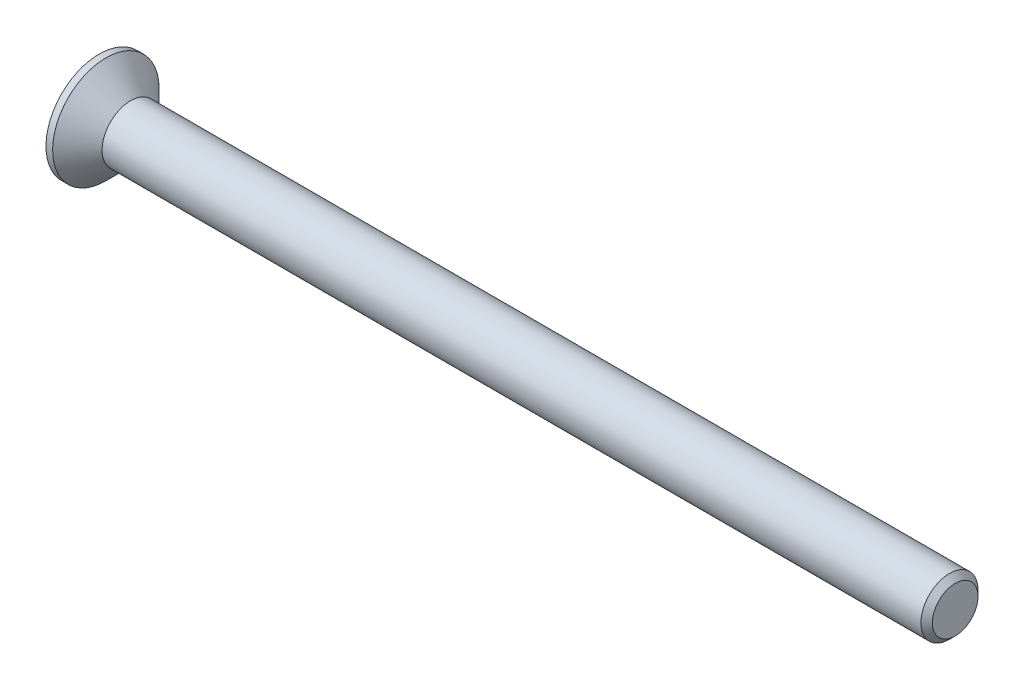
from build123d import *

# Parameters (mm, degrees)
CHAMFER1_SIZE      = 0.3
CUT_EXTRUDE1_DEPTH = 1.25


with BuildPart() as part:
    # Sketch1 → Revolve1 (revolve)
    with BuildSketch(Plane.XY, mode=Mode.PRIVATE) as revolve1_sk:
        Polygon((-1.65, 2.8), (-1.65, 0), (43.35, 0), (43.35, 1.5), (0, 1.5), (-1.3, 2.8), align=None)
    revolve(revolve1_sk.sketch.rotate(Axis((-1.65, 0, 0), (1, 0, 0)), 180), axis=Axis((-1.65, 0, 0), (1, 0, 0)))

    # Chamfer1
    chamfer1_edges = [part.edges().sort_by_distance(p)[0] for p in [
        (43.35, 1.5, 0),
    ]]
    chamfer(chamfer1_edges, length=CHAMFER1_SIZE)

    # Sketch2 → Cut-Extrude1 (cut)
    with BuildSketch(Plane.ZY.offset(1.65)):
        Polygon((-0.365, 1.45), (0.365, 1.45), (0.365, 0.365), (1.45, 0.365), (1.45, -0.365), (0.365, -0.365), (0.365, -1.45), (-0.365, -1.45), (-0.365, -0.365), (-1.45, -0.365), (-1.45, 0.365), (-0.365, 0.365), align=None)
    extrude(amount=-CUT_EXTRUDE1_DEPTH, mode=Mode.SUBTRACT)


solid = part.part
